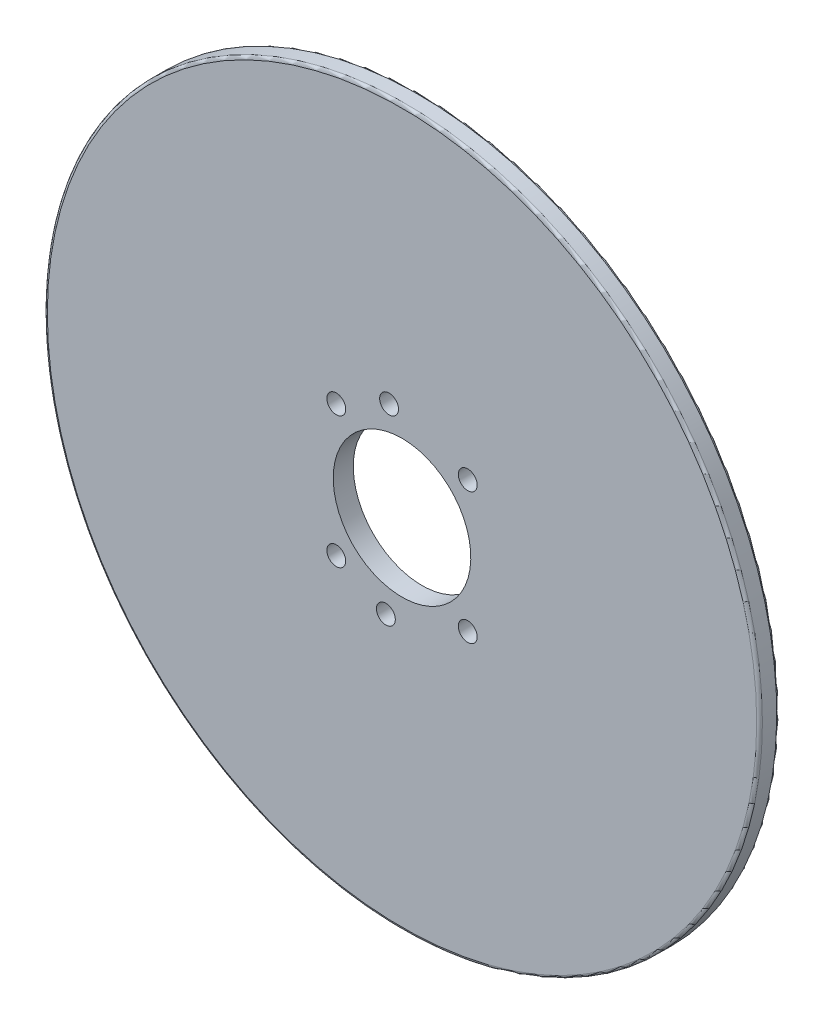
ISO-10303-21;
HEADER;
FILE_DESCRIPTION(('STEP AP214'),'2;1');
FILE_NAME('part.step','',(''),(''),'','','');
FILE_SCHEMA(('AUTOMOTIVE_DESIGN { 1 0 10303 214 1 1 1 1 }'));
ENDSEC;
DATA;
#1=APPLICATION_CONTEXT('core data for automotive mechanical design processes');
#2=APPLICATION_PROTOCOL_DEFINITION('international standard','automotive_design',2000,#1);
#3=PRODUCT_CONTEXT('',#1,'mechanical');
#4=PRODUCT('Part','Part','',(#3));
#5=PRODUCT_RELATED_PRODUCT_CATEGORY('part','',(#4));
#6=PRODUCT_DEFINITION_FORMATION('','',#4);
#7=PRODUCT_DEFINITION_CONTEXT('part definition',#1,'design');
#8=PRODUCT_DEFINITION('design','',#6,#7);
#9=PRODUCT_DEFINITION_SHAPE('','',#8);
#10=(LENGTH_UNIT() NAMED_UNIT(*) SI_UNIT(.MILLI.,.METRE.));
#11=(NAMED_UNIT(*) PLANE_ANGLE_UNIT() SI_UNIT($,.RADIAN.));
#12=(NAMED_UNIT(*) SI_UNIT($,.STERADIAN.) SOLID_ANGLE_UNIT());
#13=UNCERTAINTY_MEASURE_WITH_UNIT(LENGTH_MEASURE(1.E-05),#10,'distance_accuracy_value','');
#14=(GEOMETRIC_REPRESENTATION_CONTEXT(3) GLOBAL_UNCERTAINTY_ASSIGNED_CONTEXT((#13)) GLOBAL_UNIT_ASSIGNED_CONTEXT((#10,
#11,#12)) REPRESENTATION_CONTEXT('',''));
#15=CARTESIAN_POINT('',(0.,0.,0.));
#16=DIRECTION('',(0.,0.,1.));
#17=DIRECTION('',(1.,0.,0.));
#18=AXIS2_PLACEMENT_3D('',#15,#16,#17);
#19=CARTESIAN_POINT('',(1171.91535089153,1233.69826691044,121.319898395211));
#20=DIRECTION('',(0.,0.,-1.));
#21=DIRECTION('',(0.707106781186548,-0.707106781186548,0.));
#22=AXIS2_PLACEMENT_3D('',#19,#20,#21);
#23=TOROIDAL_SURFACE('',#22,123.999999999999,1.00000000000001);
#24=CARTESIAN_POINT('',(1171.91535089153,1233.69826691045,121.319898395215));
#25=DIRECTION('',(0.,0.,1.));
#26=DIRECTION('',(1.,0.,0.));
#27=AXIS2_PLACEMENT_3D('',#24,#25,#26);
#28=CIRCLE('',#27,125.);
#29=CARTESIAN_POINT('',(1296.91535089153,1233.69826691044,121.319898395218));
#30=VERTEX_POINT('',#29);
#31=EDGE_CURVE('E75',#30,#30,#28,.T.);
#32=ORIENTED_EDGE('',*,*,#31,.T.);
#33=EDGE_LOOP('',(#32));
#34=FACE_BOUND('',#33,.T.);
#35=CARTESIAN_POINT('',(1171.91535089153,1233.69826691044,122.319898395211));
#36=DIRECTION('',(0.,0.,-1.));
#37=DIRECTION('',(1.,0.,0.));
#38=AXIS2_PLACEMENT_3D('',#35,#36,#37);
#39=CIRCLE('',#38,123.999999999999);
#40=CARTESIAN_POINT('',(1295.91535089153,1233.69826691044,122.319898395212));
#41=VERTEX_POINT('',#40);
#42=EDGE_CURVE('E79',#41,#41,#39,.F.);
#43=ORIENTED_EDGE('',*,*,#42,.F.);
#44=EDGE_LOOP('',(#43));
#45=FACE_BOUND('',#44,.T.);
#46=ADVANCED_FACE('F14',(#34,#45),#23,.T.);
#47=CARTESIAN_POINT('',(1047.91535089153,1109.69826691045,122.319898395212));
#48=DIRECTION('',(0.,0.,1.));
#49=DIRECTION('',(0.,-1.,0.));
#50=AXIS2_PLACEMENT_3D('',#47,#48,#49);
#51=PLANE('',#50);
#52=ORIENTED_EDGE('',*,*,#42,.T.);
#53=EDGE_LOOP('',(#52));
#54=FACE_BOUND('',#53,.T.);
#55=CARTESIAN_POINT('',(1194.89632128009,1256.67923729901,122.319898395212));
#56=DIRECTION('',(0.,0.,-1.));
#57=DIRECTION('',(-1.,0.,0.));
#58=AXIS2_PLACEMENT_3D('',#55,#56,#57);
#59=CIRCLE('',#58,3.30000000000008);
#60=CARTESIAN_POINT('',(1191.59632128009,1256.67923729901,122.319898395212));
#61=VERTEX_POINT('',#60);
#62=EDGE_CURVE('E56',#61,#61,#59,.F.);
#63=ORIENTED_EDGE('',*,*,#62,.F.);
#64=EDGE_LOOP('',(#63));
#65=FACE_BOUND('',#64,.T.);
#66=CARTESIAN_POINT('',(1194.89632128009,1210.71729652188,122.319898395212));
#67=DIRECTION('',(0.,0.,-1.));
#68=DIRECTION('',(-1.,0.,0.));
#69=AXIS2_PLACEMENT_3D('',#66,#67,#68);
#70=CIRCLE('',#69,3.30000000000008);
#71=CARTESIAN_POINT('',(1191.59632128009,1210.71729652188,122.319898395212));
#72=VERTEX_POINT('',#71);
#73=EDGE_CURVE('E59',#72,#72,#70,.F.);
#74=ORIENTED_EDGE('',*,*,#73,.F.);
#75=EDGE_LOOP('',(#74));
#76=FACE_BOUND('',#75,.T.);
#77=CARTESIAN_POINT('',(1148.93438050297,1256.67923729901,122.319898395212));
#78=DIRECTION('',(0.,0.,-1.));
#79=DIRECTION('',(-1.,0.,0.));
#80=AXIS2_PLACEMENT_3D('',#77,#78,#79);
#81=CIRCLE('',#80,3.29999999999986);
#82=CARTESIAN_POINT('',(1145.63438050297,1256.67923729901,122.319898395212));
#83=VERTEX_POINT('',#82);
#84=EDGE_CURVE('E62',#83,#83,#81,.F.);
#85=ORIENTED_EDGE('',*,*,#84,.F.);
#86=EDGE_LOOP('',(#85));
#87=FACE_BOUND('',#86,.T.);
#88=CARTESIAN_POINT('',(1148.93438050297,1210.71729652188,122.319898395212));
#89=DIRECTION('',(0.,0.,-1.));
#90=DIRECTION('',(-1.,0.,0.));
#91=AXIS2_PLACEMENT_3D('',#88,#89,#90);
#92=CIRCLE('',#91,3.30000000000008);
#93=CARTESIAN_POINT('',(1145.63438050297,1210.71729652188,122.319898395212));
#94=VERTEX_POINT('',#93);
#95=EDGE_CURVE('E65',#94,#94,#92,.F.);
#96=ORIENTED_EDGE('',*,*,#95,.F.);
#97=EDGE_LOOP('',(#96));
#98=FACE_BOUND('',#97,.T.);
#99=CARTESIAN_POINT('',(1171.91535089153,1233.69826691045,122.319898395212));
#100=DIRECTION('',(0.,0.,-1.));
#101=DIRECTION('',(0.,1.,0.));
#102=AXIS2_PLACEMENT_3D('',#99,#100,#101);
#103=CIRCLE('',#102,24.0500000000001);
#104=CARTESIAN_POINT('',(1171.91535089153,1257.74826691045,122.319898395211));
#105=VERTEX_POINT('',#104);
#106=EDGE_CURVE('E68',#105,#105,#103,.F.);
#107=ORIENTED_EDGE('',*,*,#106,.F.);
#108=EDGE_LOOP('',(#107));
#109=FACE_BOUND('',#108,.T.);
#110=CARTESIAN_POINT('',(1166.27178511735,1201.69201493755,122.319898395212));
#111=DIRECTION('',(0.,0.,-1.));
#112=DIRECTION('',(-1.,0.,0.));
#113=AXIS2_PLACEMENT_3D('',#110,#111,#112);
#114=CIRCLE('',#113,3.30000000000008);
#115=CARTESIAN_POINT('',(1162.97178511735,1201.69201493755,122.319898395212));
#116=VERTEX_POINT('',#115);
#117=EDGE_CURVE('E70',#116,#116,#114,.F.);
#118=ORIENTED_EDGE('',*,*,#117,.F.);
#119=EDGE_LOOP('',(#118));
#120=FACE_BOUND('',#119,.T.);
#121=CARTESIAN_POINT('',(1167.39222511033,1265.88197914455,122.319898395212));
#122=DIRECTION('',(0.,0.,-1.));
#123=DIRECTION('',(0.,1.,0.));
#124=AXIS2_PLACEMENT_3D('',#121,#122,#123);
#125=CIRCLE('',#124,3.29999999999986);
#126=CARTESIAN_POINT('',(1167.39222511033,1269.18197914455,122.319898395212));
#127=VERTEX_POINT('',#126);
#128=EDGE_CURVE('E19',#127,#127,#125,.F.);
#129=ORIENTED_EDGE('',*,*,#128,.F.);
#130=EDGE_LOOP('',(#129));
#131=FACE_BOUND('',#130,.T.);
#132=ADVANCED_FACE('F112',(#54,#65,#76,#87,#98,#109,#120,#131),#51,.T.);
#133=CARTESIAN_POINT('',(1171.91535089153,1233.69826691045,121.319898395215));
#134=DIRECTION('',(0.,0.,-1.));
#135=DIRECTION('',(-1.,0.,0.));
#136=AXIS2_PLACEMENT_3D('',#133,#134,#135);
#137=CYLINDRICAL_SURFACE('',#136,125.);
#138=CARTESIAN_POINT('',(1171.91535089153,1233.69826691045,116.319898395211));
#139=DIRECTION('',(0.,0.,1.));
#140=DIRECTION('',(-0.707106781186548,0.707106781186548,0.));
#141=AXIS2_PLACEMENT_3D('',#138,#139,#140);
#142=CIRCLE('',#141,125.000000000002);
#143=CARTESIAN_POINT('',(1083.52700324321,1322.08661455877,116.31989839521));
#144=VERTEX_POINT('',#143);
#145=EDGE_CURVE('E55',#144,#144,#142,.T.);
#146=ORIENTED_EDGE('',*,*,#145,.T.);
#147=EDGE_LOOP('',(#146));
#148=FACE_BOUND('',#147,.T.);
#149=ORIENTED_EDGE('',*,*,#31,.F.);
#150=EDGE_LOOP('',(#149));
#151=FACE_BOUND('',#150,.T.);
#152=ADVANCED_FACE('F121',(#148,#151),#137,.T.);
#153=CARTESIAN_POINT('',(1167.39222511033,1265.88197914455,122.319898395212));
#154=DIRECTION('',(0.,0.,-1.));
#155=DIRECTION('',(0.,1.,0.));
#156=AXIS2_PLACEMENT_3D('',#153,#154,#155);
#157=CYLINDRICAL_SURFACE('',#156,3.29999999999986);
#158=ORIENTED_EDGE('',*,*,#128,.T.);
#159=EDGE_LOOP('',(#158));
#160=FACE_BOUND('',#159,.T.);
#161=CARTESIAN_POINT('',(1167.39222511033,1265.88197914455,115.319898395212));
#162=DIRECTION('',(0.,0.,-1.));
#163=DIRECTION('',(0.,1.,0.));
#164=AXIS2_PLACEMENT_3D('',#161,#162,#163);
#165=CIRCLE('',#164,3.29999999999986);
#166=CARTESIAN_POINT('',(1167.39222511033,1269.18197914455,115.319898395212));
#167=VERTEX_POINT('',#166);
#168=EDGE_CURVE('E52',#167,#167,#165,.T.);
#169=ORIENTED_EDGE('',*,*,#168,.T.);
#170=EDGE_LOOP('',(#169));
#171=FACE_BOUND('',#170,.T.);
#172=ADVANCED_FACE('F124',(#160,#171),#157,.F.);
#173=CARTESIAN_POINT('',(1166.27178511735,1201.69201493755,122.319898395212));
#174=DIRECTION('',(0.,0.,-1.));
#175=DIRECTION('',(-1.,0.,0.));
#176=AXIS2_PLACEMENT_3D('',#173,#174,#175);
#177=CYLINDRICAL_SURFACE('',#176,3.30000000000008);
#178=ORIENTED_EDGE('',*,*,#117,.T.);
#179=EDGE_LOOP('',(#178));
#180=FACE_BOUND('',#179,.T.);
#181=CARTESIAN_POINT('',(1166.27178511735,1201.69201493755,115.319898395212));
#182=DIRECTION('',(0.,0.,-1.));
#183=DIRECTION('',(-1.,0.,0.));
#184=AXIS2_PLACEMENT_3D('',#181,#182,#183);
#185=CIRCLE('',#184,3.30000000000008);
#186=CARTESIAN_POINT('',(1162.97178511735,1201.69201493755,115.319898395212));
#187=VERTEX_POINT('',#186);
#188=EDGE_CURVE('E49',#187,#187,#185,.T.);
#189=ORIENTED_EDGE('',*,*,#188,.T.);
#190=EDGE_LOOP('',(#189));
#191=FACE_BOUND('',#190,.T.);
#192=ADVANCED_FACE('F128',(#180,#191),#177,.F.);
#193=CARTESIAN_POINT('',(1171.91535089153,1233.69826691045,122.319898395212));
#194=DIRECTION('',(0.,0.,-1.));
#195=DIRECTION('',(0.,1.,0.));
#196=AXIS2_PLACEMENT_3D('',#193,#194,#195);
#197=CYLINDRICAL_SURFACE('',#196,24.0500000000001);
#198=CARTESIAN_POINT('',(1171.91535089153,1233.69826691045,115.319898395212));
#199=DIRECTION('',(0.,0.,-1.));
#200=DIRECTION('',(0.,1.,0.));
#201=AXIS2_PLACEMENT_3D('',#198,#199,#200);
#202=CIRCLE('',#201,24.0500000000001);
#203=CARTESIAN_POINT('',(1171.91535089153,1257.74826691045,115.319898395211));
#204=VERTEX_POINT('',#203);
#205=EDGE_CURVE('E46',#204,#204,#202,.T.);
#206=ORIENTED_EDGE('',*,*,#205,.T.);
#207=EDGE_LOOP('',(#206));
#208=FACE_BOUND('',#207,.T.);
#209=ORIENTED_EDGE('',*,*,#106,.T.);
#210=EDGE_LOOP('',(#209));
#211=FACE_BOUND('',#210,.T.);
#212=ADVANCED_FACE('F131',(#208,#211),#197,.F.);
#213=CARTESIAN_POINT('',(1148.93438050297,1210.71729652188,122.319898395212));
#214=DIRECTION('',(0.,0.,-1.));
#215=DIRECTION('',(-1.,0.,0.));
#216=AXIS2_PLACEMENT_3D('',#213,#214,#215);
#217=CYLINDRICAL_SURFACE('',#216,3.30000000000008);
#218=ORIENTED_EDGE('',*,*,#95,.T.);
#219=EDGE_LOOP('',(#218));
#220=FACE_BOUND('',#219,.T.);
#221=CARTESIAN_POINT('',(1148.93438050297,1210.71729652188,115.319898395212));
#222=DIRECTION('',(0.,0.,-1.));
#223=DIRECTION('',(-1.,0.,0.));
#224=AXIS2_PLACEMENT_3D('',#221,#222,#223);
#225=CIRCLE('',#224,3.30000000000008);
#226=CARTESIAN_POINT('',(1145.63438050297,1210.71729652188,115.319898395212));
#227=VERTEX_POINT('',#226);
#228=EDGE_CURVE('E43',#227,#227,#225,.T.);
#229=ORIENTED_EDGE('',*,*,#228,.T.);
#230=EDGE_LOOP('',(#229));
#231=FACE_BOUND('',#230,.T.);
#232=ADVANCED_FACE('F134',(#220,#231),#217,.F.);
#233=CARTESIAN_POINT('',(1148.93438050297,1256.67923729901,122.319898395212));
#234=DIRECTION('',(0.,0.,-1.));
#235=DIRECTION('',(-1.,0.,0.));
#236=AXIS2_PLACEMENT_3D('',#233,#234,#235);
#237=CYLINDRICAL_SURFACE('',#236,3.29999999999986);
#238=ORIENTED_EDGE('',*,*,#84,.T.);
#239=EDGE_LOOP('',(#238));
#240=FACE_BOUND('',#239,.T.);
#241=CARTESIAN_POINT('',(1148.93438050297,1256.67923729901,115.319898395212));
#242=DIRECTION('',(0.,0.,-1.));
#243=DIRECTION('',(-1.,0.,0.));
#244=AXIS2_PLACEMENT_3D('',#241,#242,#243);
#245=CIRCLE('',#244,3.29999999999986);
#246=CARTESIAN_POINT('',(1145.63438050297,1256.67923729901,115.319898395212));
#247=VERTEX_POINT('',#246);
#248=EDGE_CURVE('E33',#247,#247,#245,.T.);
#249=ORIENTED_EDGE('',*,*,#248,.T.);
#250=EDGE_LOOP('',(#249));
#251=FACE_BOUND('',#250,.T.);
#252=ADVANCED_FACE('F138',(#240,#251),#237,.F.);
#253=CARTESIAN_POINT('',(1194.89632128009,1210.71729652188,122.319898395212));
#254=DIRECTION('',(0.,0.,-1.));
#255=DIRECTION('',(-1.,0.,0.));
#256=AXIS2_PLACEMENT_3D('',#253,#254,#255);
#257=CYLINDRICAL_SURFACE('',#256,3.30000000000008);
#258=ORIENTED_EDGE('',*,*,#73,.T.);
#259=EDGE_LOOP('',(#258));
#260=FACE_BOUND('',#259,.T.);
#261=CARTESIAN_POINT('',(1194.89632128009,1210.71729652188,115.319898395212));
#262=DIRECTION('',(0.,0.,-1.));
#263=DIRECTION('',(-1.,0.,0.));
#264=AXIS2_PLACEMENT_3D('',#261,#262,#263);
#265=CIRCLE('',#264,3.30000000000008);
#266=CARTESIAN_POINT('',(1191.59632128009,1210.71729652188,115.319898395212));
#267=VERTEX_POINT('',#266);
#268=EDGE_CURVE('E28',#267,#267,#265,.T.);
#269=ORIENTED_EDGE('',*,*,#268,.T.);
#270=EDGE_LOOP('',(#269));
#271=FACE_BOUND('',#270,.T.);
#272=ADVANCED_FACE('F141',(#260,#271),#257,.F.);
#273=CARTESIAN_POINT('',(1194.89632128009,1256.67923729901,122.319898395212));
#274=DIRECTION('',(0.,0.,-1.));
#275=DIRECTION('',(-1.,0.,0.));
#276=AXIS2_PLACEMENT_3D('',#273,#274,#275);
#277=CYLINDRICAL_SURFACE('',#276,3.30000000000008);
#278=ORIENTED_EDGE('',*,*,#62,.T.);
#279=EDGE_LOOP('',(#278));
#280=FACE_BOUND('',#279,.T.);
#281=CARTESIAN_POINT('',(1194.89632128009,1256.67923729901,115.319898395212));
#282=DIRECTION('',(0.,0.,-1.));
#283=DIRECTION('',(-1.,0.,0.));
#284=AXIS2_PLACEMENT_3D('',#281,#282,#283);
#285=CIRCLE('',#284,3.30000000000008);
#286=CARTESIAN_POINT('',(1191.59632128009,1256.67923729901,115.319898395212));
#287=VERTEX_POINT('',#286);
#288=EDGE_CURVE('E23',#287,#287,#285,.T.);
#289=ORIENTED_EDGE('',*,*,#288,.T.);
#290=EDGE_LOOP('',(#289));
#291=FACE_BOUND('',#290,.T.);
#292=ADVANCED_FACE('F97',(#280,#291),#277,.F.);
#293=CARTESIAN_POINT('',(1171.91535089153,1233.69826691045,116.319898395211));
#294=DIRECTION('',(0.,0.,1.));
#295=DIRECTION('',(-0.707106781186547,0.707106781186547,0.));
#296=AXIS2_PLACEMENT_3D('',#293,#294,#295);
#297=TOROIDAL_SURFACE('',#296,124.000000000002,1.00000000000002);
#298=ORIENTED_EDGE('',*,*,#145,.F.);
#299=EDGE_LOOP('',(#298));
#300=FACE_BOUND('',#299,.T.);
#301=CARTESIAN_POINT('',(1171.91535089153,1233.69826691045,115.319898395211));
#302=DIRECTION('',(0.,0.,1.));
#303=DIRECTION('',(1.,0.,0.));
#304=AXIS2_PLACEMENT_3D('',#301,#302,#303);
#305=CIRCLE('',#304,123.999999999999);
#306=CARTESIAN_POINT('',(1295.91535089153,1233.69826691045,115.31989839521));
#307=VERTEX_POINT('',#306);
#308=EDGE_CURVE('E10',#307,#307,#305,.T.);
#309=ORIENTED_EDGE('',*,*,#308,.T.);
#310=EDGE_LOOP('',(#309));
#311=FACE_BOUND('',#310,.T.);
#312=ADVANCED_FACE('F93',(#300,#311),#297,.T.);
#313=CARTESIAN_POINT('',(1047.91535089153,1109.69826691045,115.319898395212));
#314=DIRECTION('',(0.,0.,1.));
#315=DIRECTION('',(0.,-1.,0.));
#316=AXIS2_PLACEMENT_3D('',#313,#314,#315);
#317=PLANE('',#316);
#318=ORIENTED_EDGE('',*,*,#308,.F.);
#319=EDGE_LOOP('',(#318));
#320=FACE_BOUND('',#319,.T.);
#321=ORIENTED_EDGE('',*,*,#288,.F.);
#322=EDGE_LOOP('',(#321));
#323=FACE_BOUND('',#322,.T.);
#324=ORIENTED_EDGE('',*,*,#268,.F.);
#325=EDGE_LOOP('',(#324));
#326=FACE_BOUND('',#325,.T.);
#327=ORIENTED_EDGE('',*,*,#248,.F.);
#328=EDGE_LOOP('',(#327));
#329=FACE_BOUND('',#328,.T.);
#330=ORIENTED_EDGE('',*,*,#228,.F.);
#331=EDGE_LOOP('',(#330));
#332=FACE_BOUND('',#331,.T.);
#333=ORIENTED_EDGE('',*,*,#205,.F.);
#334=EDGE_LOOP('',(#333));
#335=FACE_BOUND('',#334,.T.);
#336=ORIENTED_EDGE('',*,*,#188,.F.);
#337=EDGE_LOOP('',(#336));
#338=FACE_BOUND('',#337,.T.);
#339=ORIENTED_EDGE('',*,*,#168,.F.);
#340=EDGE_LOOP('',(#339));
#341=FACE_BOUND('',#340,.T.);
#342=ADVANCED_FACE('F16',(#320,#323,#326,#329,#332,#335,#338,#341),#317,.F.);
#343=CLOSED_SHELL('',(#46,#132,#152,#172,#192,#212,#232,#252,#272,#292,#312,#342));
#344=MANIFOLD_SOLID_BREP('B1',#343);
#345=ADVANCED_BREP_SHAPE_REPRESENTATION('',(#18,#344),#14);
#346=SHAPE_DEFINITION_REPRESENTATION(#9,#345);
ENDSEC;
END-ISO-10303-21;
